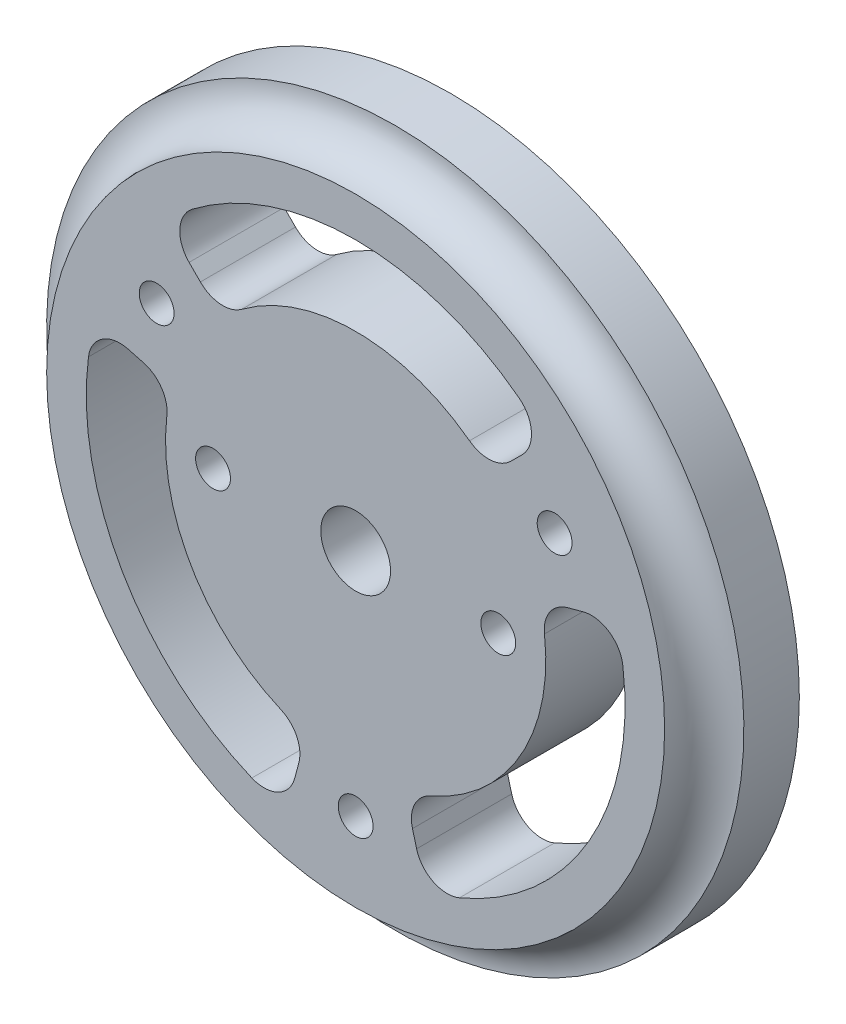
ISO-10303-21;
HEADER;
FILE_DESCRIPTION(('STEP AP214'),'2;1');
FILE_NAME('part.step','',(''),(''),'','','');
FILE_SCHEMA(('AUTOMOTIVE_DESIGN { 1 0 10303 214 1 1 1 1 }'));
ENDSEC;
DATA;
#1=APPLICATION_CONTEXT('core data for automotive mechanical design processes');
#2=APPLICATION_PROTOCOL_DEFINITION('international standard','automotive_design',2000,#1);
#3=PRODUCT_CONTEXT('',#1,'mechanical');
#4=PRODUCT('Part','Part','',(#3));
#5=PRODUCT_RELATED_PRODUCT_CATEGORY('part','',(#4));
#6=PRODUCT_DEFINITION_FORMATION('','',#4);
#7=PRODUCT_DEFINITION_CONTEXT('part definition',#1,'design');
#8=PRODUCT_DEFINITION('design','',#6,#7);
#9=PRODUCT_DEFINITION_SHAPE('','',#8);
#10=(LENGTH_UNIT() NAMED_UNIT(*) SI_UNIT(.MILLI.,.METRE.));
#11=(NAMED_UNIT(*) PLANE_ANGLE_UNIT() SI_UNIT($,.RADIAN.));
#12=(NAMED_UNIT(*) SI_UNIT($,.STERADIAN.) SOLID_ANGLE_UNIT());
#13=UNCERTAINTY_MEASURE_WITH_UNIT(LENGTH_MEASURE(1.E-05),#10,'distance_accuracy_value','');
#14=(GEOMETRIC_REPRESENTATION_CONTEXT(3) GLOBAL_UNCERTAINTY_ASSIGNED_CONTEXT((#13)) GLOBAL_UNIT_ASSIGNED_CONTEXT((#10,
#11,#12)) REPRESENTATION_CONTEXT('',''));
#15=CARTESIAN_POINT('',(0.,0.,0.));
#16=DIRECTION('',(0.,0.,1.));
#17=DIRECTION('',(1.,0.,0.));
#18=AXIS2_PLACEMENT_3D('',#15,#16,#17);
#19=CARTESIAN_POINT('',(0.,0.,6.));
#20=DIRECTION('',(0.,0.,1.));
#21=DIRECTION('',(1.,0.,0.));
#22=AXIS2_PLACEMENT_3D('',#19,#20,#21);
#23=PLANE('',#22);
#24=CARTESIAN_POINT('',(0.,0.,5.99999999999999));
#25=DIRECTION('',(0.,0.,-1.));
#26=DIRECTION('',(0.,1.,0.));
#27=AXIS2_PLACEMENT_3D('',#24,#25,#26);
#28=CIRCLE('',#27,19.5);
#29=CARTESIAN_POINT('',(0.,19.5,6.));
#30=VERTEX_POINT('',#29);
#31=EDGE_CURVE('E427',#30,#30,#28,.T.);
#32=ORIENTED_EDGE('',*,*,#31,.F.);
#33=EDGE_LOOP('',(#32));
#34=FACE_BOUND('',#33,.T.);
#35=CARTESIAN_POINT('',(-9.,0.,6.));
#36=DIRECTION('',(0.,0.,1.));
#37=DIRECTION('',(1.,0.,0.));
#38=AXIS2_PLACEMENT_3D('',#35,#36,#37);
#39=CIRCLE('',#38,1.1);
#40=CARTESIAN_POINT('',(-7.9,0.,6.));
#41=VERTEX_POINT('',#40);
#42=EDGE_CURVE('E231',#41,#41,#39,.T.);
#43=ORIENTED_EDGE('',*,*,#42,.F.);
#44=EDGE_LOOP('',(#43));
#45=FACE_BOUND('',#44,.T.);
#46=CARTESIAN_POINT('',(3.18635775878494E-12,-8.61816253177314E-12,6.));
#47=DIRECTION('',(0.,0.,1.));
#48=DIRECTION('',(1.,0.,0.));
#49=AXIS2_PLACEMENT_3D('',#46,#47,#48);
#50=CIRCLE('',#49,17.000000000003);
#51=CARTESIAN_POINT('',(6.55006981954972,-15.6874658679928,6.));
#52=VERTEX_POINT('',#51);
#53=CARTESIAN_POINT('',(16.8607788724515,2.17120607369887,6.));
#54=VERTEX_POINT('',#53);
#55=EDGE_CURVE('E263',#52,#54,#50,.T.);
#56=ORIENTED_EDGE('',*,*,#55,.F.);
#57=CARTESIAN_POINT('',(5.77947337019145,-13.8418816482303,6.));
#58=DIRECTION('',(0.,0.,1.));
#59=DIRECTION('',(-1.,0.,0.));
#60=AXIS2_PLACEMENT_3D('',#57,#58,#59);
#61=CIRCLE('',#60,2.);
#62=CARTESIAN_POINT('',(3.8476217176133,-14.3595197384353,6.));
#63=VERTEX_POINT('',#62);
#64=EDGE_CURVE('E261',#63,#52,#61,.T.);
#65=ORIENTED_EDGE('',*,*,#64,.F.);
#66=DIRECTION('',(0.258819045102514,-0.96592582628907,0.));
#67=VECTOR('',#66,1.);
#68=CARTESIAN_POINT('',(3.58630188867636,-13.3842608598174,6.));
#69=LINE('',#68,#67);
#70=CARTESIAN_POINT('',(3.58630188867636,-13.3842608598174,6.));
#71=VERTEX_POINT('',#70);
#72=EDGE_CURVE('E277',#71,#63,#69,.T.);
#73=ORIENTED_EDGE('',*,*,#72,.F.);
#74=CARTESIAN_POINT('',(5.5181535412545,-12.8666227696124,6.));
#75=DIRECTION('',(0.,0.,1.));
#76=DIRECTION('',(1.,0.,0.));
#77=AXIS2_PLACEMENT_3D('',#74,#75,#76);
#78=CIRCLE('',#77,2.);
#79=CARTESIAN_POINT('',(4.72984589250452,-11.0285338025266,6.));
#80=VERTEX_POINT('',#79);
#81=EDGE_CURVE('E274',#80,#71,#78,.T.);
#82=ORIENTED_EDGE('',*,*,#81,.F.);
#83=CARTESIAN_POINT('',(3.18635775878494E-12,-8.61816253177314E-12,6.));
#84=DIRECTION('',(0.,0.,-1.));
#85=DIRECTION('',(1.,0.,0.));
#86=AXIS2_PLACEMENT_3D('',#83,#84,#85);
#87=CIRCLE('',#86,12.0000000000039);
#88=CARTESIAN_POINT('',(11.9159133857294,1.41810020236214,6.));
#89=VERTEX_POINT('',#88);
#90=EDGE_CURVE('E272',#89,#80,#87,.T.);
#91=ORIENTED_EDGE('',*,*,#90,.F.);
#92=CARTESIAN_POINT('',(13.9018989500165,1.65445023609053,6.));
#93=DIRECTION('',(0.,0.,1.));
#94=DIRECTION('',(-1.,0.,0.));
#95=AXIS2_PLACEMENT_3D('',#92,#93,#94);
#96=CIRCLE('',#95,2.);
#97=CARTESIAN_POINT('',(13.3842608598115,3.58630188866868,6.));
#98=VERTEX_POINT('',#97);
#99=EDGE_CURVE('E270',#98,#89,#96,.T.);
#100=ORIENTED_EDGE('',*,*,#99,.F.);
#101=DIRECTION('',(-0.965925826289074,-0.258819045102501,0.));
#102=VECTOR('',#101,1.);
#103=CARTESIAN_POINT('',(13.3842608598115,3.58630188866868,6.));
#104=LINE('',#103,#102);
#105=CARTESIAN_POINT('',(14.3595197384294,3.8476217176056,6.));
#106=VERTEX_POINT('',#105);
#107=EDGE_CURVE('E268',#106,#98,#104,.T.);
#108=ORIENTED_EDGE('',*,*,#107,.F.);
#109=CARTESIAN_POINT('',(14.8771578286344,1.91577006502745,6.));
#110=DIRECTION('',(0.,0.,1.));
#111=DIRECTION('',(1.,0.,0.));
#112=AXIS2_PLACEMENT_3D('',#109,#110,#111);
#113=CIRCLE('',#112,2.);
#114=EDGE_CURVE('E266',#54,#106,#113,.T.);
#115=ORIENTED_EDGE('',*,*,#114,.F.);
#116=EDGE_LOOP('',(#56,#65,#73,#82,#91,#100,#108,#115));
#117=FACE_BOUND('',#116,.T.);
#118=CARTESIAN_POINT('',(12.5573683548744,7.24999999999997,6.));
#119=DIRECTION('',(0.,0.,1.));
#120=DIRECTION('',(1.,0.,0.));
#121=AXIS2_PLACEMENT_3D('',#118,#119,#120);
#122=CIRCLE('',#121,1.1);
#123=CARTESIAN_POINT('',(13.6573683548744,7.24999999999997,6.));
#124=VERTEX_POINT('',#123);
#125=EDGE_CURVE('E326',#124,#124,#122,.T.);
#126=ORIENTED_EDGE('',*,*,#125,.F.);
#127=EDGE_LOOP('',(#126));
#128=FACE_BOUND('',#127,.T.);
#129=CARTESIAN_POINT('',(-9.09768445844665,11.9261115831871,6.));
#130=DIRECTION('',(0.,0.,1.));
#131=DIRECTION('',(1.,0.,0.));
#132=AXIS2_PLACEMENT_3D('',#129,#130,#131);
#133=CIRCLE('',#132,1.99999999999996);
#134=CARTESIAN_POINT('',(-10.3107090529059,13.5162597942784,6.));
#135=VERTEX_POINT('',#134);
#136=CARTESIAN_POINT('',(-10.5118980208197,10.5118980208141,6.));
#137=VERTEX_POINT('',#136);
#138=EDGE_CURVE('E340',#135,#137,#133,.T.);
#139=ORIENTED_EDGE('',*,*,#138,.F.);
#140=CARTESIAN_POINT('',(0.,0.,6.));
#141=DIRECTION('',(0.,0.,1.));
#142=DIRECTION('',(1.,0.,0.));
#143=AXIS2_PLACEMENT_3D('',#140,#141,#142);
#144=CIRCLE('',#143,17.000000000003);
#145=CARTESIAN_POINT('',(10.3107090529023,13.5162597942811,6.));
#146=VERTEX_POINT('',#145);
#147=EDGE_CURVE('E338',#146,#135,#144,.T.);
#148=ORIENTED_EDGE('',*,*,#147,.F.);
#149=CARTESIAN_POINT('',(9.09768445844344,11.9261115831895,6.));
#150=DIRECTION('',(0.,0.,1.));
#151=DIRECTION('',(-1.,0.,0.));
#152=AXIS2_PLACEMENT_3D('',#149,#150,#151);
#153=CIRCLE('',#152,2.00000000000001);
#154=CARTESIAN_POINT('',(10.5118980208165,10.5118980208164,6.));
#155=VERTEX_POINT('',#154);
#156=EDGE_CURVE('E354',#155,#146,#153,.T.);
#157=ORIENTED_EDGE('',*,*,#156,.F.);
#158=DIRECTION('',(0.707106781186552,0.707106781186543,0.));
#159=VECTOR('',#158,1.);
#160=CARTESIAN_POINT('',(9.79795897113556,9.79795897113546,6.));
#161=LINE('',#160,#159);
#162=CARTESIAN_POINT('',(9.79795897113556,9.79795897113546,6.));
#163=VERTEX_POINT('',#162);
#164=EDGE_CURVE('E351',#163,#155,#161,.T.);
#165=ORIENTED_EDGE('',*,*,#164,.F.);
#166=CARTESIAN_POINT('',(8.38374540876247,11.2121725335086,6.));
#167=DIRECTION('',(0.,0.,1.));
#168=DIRECTION('',(1.,0.,0.));
#169=AXIS2_PLACEMENT_3D('',#166,#167,#168);
#170=CIRCLE('',#169,1.99999999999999);
#171=CARTESIAN_POINT('',(7.18606749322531,9.61043360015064,6.));
#172=VERTEX_POINT('',#171);
#173=EDGE_CURVE('E349',#172,#163,#170,.T.);
#174=ORIENTED_EDGE('',*,*,#173,.F.);
#175=CARTESIAN_POINT('',(0.,0.,6.));
#176=DIRECTION('',(0.,0.,-1.));
#177=DIRECTION('',(1.,0.,0.));
#178=AXIS2_PLACEMENT_3D('',#175,#176,#177);
#179=CIRCLE('',#178,12.0000000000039);
#180=CARTESIAN_POINT('',(-7.18606749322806,9.61043360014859,6.));
#181=VERTEX_POINT('',#180);
#182=EDGE_CURVE('E347',#181,#172,#179,.T.);
#183=ORIENTED_EDGE('',*,*,#182,.F.);
#184=CARTESIAN_POINT('',(-8.38374540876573,11.2121725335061,6.));
#185=DIRECTION('',(0.,0.,1.));
#186=DIRECTION('',(-1.,0.,0.));
#187=AXIS2_PLACEMENT_3D('',#184,#185,#186);
#188=CIRCLE('',#187,1.99999999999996);
#189=CARTESIAN_POINT('',(-9.79795897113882,9.79795897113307,6.));
#190=VERTEX_POINT('',#189);
#191=EDGE_CURVE('E345',#190,#181,#188,.T.);
#192=ORIENTED_EDGE('',*,*,#191,.F.);
#193=DIRECTION('',(0.707106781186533,-0.707106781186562,0.));
#194=VECTOR('',#193,1.);
#195=CARTESIAN_POINT('',(-9.7979589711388,9.7979589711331,6.));
#196=LINE('',#195,#194);
#197=EDGE_CURVE('E343',#137,#190,#196,.T.);
#198=ORIENTED_EDGE('',*,*,#197,.F.);
#199=EDGE_LOOP('',(#139,#148,#157,#165,#174,#183,#192,#198));
#200=FACE_BOUND('',#199,.T.);
#201=CARTESIAN_POINT('',(0.,0.,6.));
#202=DIRECTION('',(0.,0.,1.));
#203=DIRECTION('',(1.,0.,0.));
#204=AXIS2_PLACEMENT_3D('',#201,#202,#203);
#205=CIRCLE('',#204,2.2);
#206=CARTESIAN_POINT('',(2.2,0.,6.));
#207=VERTEX_POINT('',#206);
#208=EDGE_CURVE('E40',#207,#207,#205,.T.);
#209=ORIENTED_EDGE('',*,*,#208,.F.);
#210=EDGE_LOOP('',(#209));
#211=FACE_BOUND('',#210,.T.);
#212=CARTESIAN_POINT('',(0.,-14.5,6.));
#213=DIRECTION('',(0.,0.,1.));
#214=DIRECTION('',(1.,0.,0.));
#215=AXIS2_PLACEMENT_3D('',#212,#213,#214);
#216=CIRCLE('',#215,1.1);
#217=CARTESIAN_POINT('',(1.0999999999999,-14.5,6.));
#218=VERTEX_POINT('',#217);
#219=EDGE_CURVE('E332',#218,#218,#216,.T.);
#220=ORIENTED_EDGE('',*,*,#219,.F.);
#221=EDGE_LOOP('',(#220));
#222=FACE_BOUND('',#221,.T.);
#223=CARTESIAN_POINT('',(-12.5573683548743,7.25000000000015,6.));
#224=DIRECTION('',(0.,0.,1.));
#225=DIRECTION('',(1.,0.,0.));
#226=AXIS2_PLACEMENT_3D('',#223,#224,#225);
#227=CIRCLE('',#226,1.1);
#228=CARTESIAN_POINT('',(-11.4573683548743,7.25000000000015,6.));
#229=VERTEX_POINT('',#228);
#230=EDGE_CURVE('E320',#229,#229,#227,.T.);
#231=ORIENTED_EDGE('',*,*,#230,.F.);
#232=EDGE_LOOP('',(#231));
#233=FACE_BOUND('',#232,.T.);
#234=CARTESIAN_POINT('',(-5.87036880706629E-12,-7.06854803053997E-12,6.));
#235=DIRECTION('',(0.,0.,1.));
#236=DIRECTION('',(1.,0.,0.));
#237=AXIS2_PLACEMENT_3D('',#234,#235,#236);
#238=CIRCLE('',#237,17.000000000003);
#239=CARTESIAN_POINT('',(-16.8607788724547,2.17120607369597,6.));
#240=VERTEX_POINT('',#239);
#241=CARTESIAN_POINT('',(-6.55006981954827,-15.687465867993,6.));
#242=VERTEX_POINT('',#241);
#243=EDGE_CURVE('E201',#240,#242,#238,.T.);
#244=ORIENTED_EDGE('',*,*,#243,.F.);
#245=CARTESIAN_POINT('',(-14.8771578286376,1.91577006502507,6.));
#246=DIRECTION('',(0.,0.,1.));
#247=DIRECTION('',(-1.,0.,0.));
#248=AXIS2_PLACEMENT_3D('',#245,#246,#247);
#249=CIRCLE('',#248,2.);
#250=CARTESIAN_POINT('',(-14.3595197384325,3.8476217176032,6.));
#251=VERTEX_POINT('',#250);
#252=EDGE_CURVE('E193',#251,#240,#249,.T.);
#253=ORIENTED_EDGE('',*,*,#252,.F.);
#254=DIRECTION('',(-0.965925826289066,0.258819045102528,0.));
#255=VECTOR('',#254,1.);
#256=CARTESIAN_POINT('',(-13.3842608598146,3.58630188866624,6.));
#257=LINE('',#256,#255);
#258=CARTESIAN_POINT('',(-13.3842608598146,3.58630188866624,6.));
#259=VERTEX_POINT('',#258);
#260=EDGE_CURVE('E228',#259,#251,#257,.T.);
#261=ORIENTED_EDGE('',*,*,#260,.F.);
#262=CARTESIAN_POINT('',(-13.9018989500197,1.65445023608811,6.));
#263=DIRECTION('',(0.,0.,1.));
#264=DIRECTION('',(1.,0.,0.));
#265=AXIS2_PLACEMENT_3D('',#262,#263,#264);
#266=CIRCLE('',#265,2.);
#267=CARTESIAN_POINT('',(-11.9159133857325,1.41810020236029,6.));
#268=VERTEX_POINT('',#267);
#269=EDGE_CURVE('E226',#268,#259,#266,.T.);
#270=ORIENTED_EDGE('',*,*,#269,.F.);
#271=CARTESIAN_POINT('',(-5.87036880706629E-12,-7.06854803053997E-12,6.));
#272=DIRECTION('',(0.,0.,-1.));
#273=DIRECTION('',(1.,0.,0.));
#274=AXIS2_PLACEMENT_3D('',#271,#272,#273);
#275=CIRCLE('',#274,12.0000000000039);
#276=CARTESIAN_POINT('',(-4.72984589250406,-11.0285338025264,6.));
#277=VERTEX_POINT('',#276);
#278=EDGE_CURVE('E224',#277,#268,#275,.T.);
#279=ORIENTED_EDGE('',*,*,#278,.F.);
#280=CARTESIAN_POINT('',(-5.5181535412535,-12.8666227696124,6.));
#281=DIRECTION('',(0.,0.,1.));
#282=DIRECTION('',(-1.,0.,0.));
#283=AXIS2_PLACEMENT_3D('',#280,#281,#282);
#284=CIRCLE('',#283,2.);
#285=CARTESIAN_POINT('',(-3.58630188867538,-13.3842608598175,6.));
#286=VERTEX_POINT('',#285);
#287=EDGE_CURVE('E222',#286,#277,#284,.T.);
#288=ORIENTED_EDGE('',*,*,#287,.F.);
#289=DIRECTION('',(0.258819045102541,0.965925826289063,0.));
#290=VECTOR('',#289,1.);
#291=CARTESIAN_POINT('',(-3.58630188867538,-13.3842608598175,6.));
#292=LINE('',#291,#290);
#293=CARTESIAN_POINT('',(-3.84762171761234,-14.3595197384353,6.));
#294=VERTEX_POINT('',#293);
#295=EDGE_CURVE('E217',#294,#286,#292,.T.);
#296=ORIENTED_EDGE('',*,*,#295,.F.);
#297=CARTESIAN_POINT('',(-5.77947337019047,-13.8418816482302,6.));
#298=DIRECTION('',(0.,0.,1.));
#299=DIRECTION('',(1.,0.,0.));
#300=AXIS2_PLACEMENT_3D('',#297,#298,#299);
#301=CIRCLE('',#300,2.);
#302=EDGE_CURVE('E215',#242,#294,#301,.T.);
#303=ORIENTED_EDGE('',*,*,#302,.F.);
#304=EDGE_LOOP('',(#244,#253,#261,#270,#279,#288,#296,#303));
#305=FACE_BOUND('',#304,.T.);
#306=CARTESIAN_POINT('',(9.,0.,6.));
#307=DIRECTION('',(0.,0.,1.));
#308=DIRECTION('',(1.,0.,0.));
#309=AXIS2_PLACEMENT_3D('',#306,#307,#308);
#310=CIRCLE('',#309,1.1);
#311=CARTESIAN_POINT('',(10.1,0.,6.));
#312=VERTEX_POINT('',#311);
#313=EDGE_CURVE('E461',#312,#312,#310,.T.);
#314=ORIENTED_EDGE('',*,*,#313,.F.);
#315=EDGE_LOOP('',(#314));
#316=FACE_BOUND('',#315,.T.);
#317=ADVANCED_FACE('F32',(#34,#45,#117,#128,#200,#211,#222,#233,#305,#316),#23,.T.);
#318=CARTESIAN_POINT('',(0.,0.,0.));
#319=DIRECTION('',(0.,0.,1.));
#320=DIRECTION('',(1.,0.,0.));
#321=AXIS2_PLACEMENT_3D('',#318,#319,#320);
#322=PLANE('',#321);
#323=CARTESIAN_POINT('',(-9.,0.,0.));
#324=DIRECTION('',(0.,0.,1.));
#325=DIRECTION('',(1.,0.,0.));
#326=AXIS2_PLACEMENT_3D('',#323,#324,#325);
#327=CIRCLE('',#326,1.1);
#328=CARTESIAN_POINT('',(-7.9,0.,0.));
#329=VERTEX_POINT('',#328);
#330=EDGE_CURVE('E465',#329,#329,#327,.T.);
#331=ORIENTED_EDGE('',*,*,#330,.T.);
#332=EDGE_LOOP('',(#331));
#333=FACE_BOUND('',#332,.T.);
#334=CARTESIAN_POINT('',(5.77947337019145,-13.8418816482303,0.));
#335=DIRECTION('',(0.,0.,1.));
#336=DIRECTION('',(-1.,0.,0.));
#337=AXIS2_PLACEMENT_3D('',#334,#335,#336);
#338=CIRCLE('',#337,2.);
#339=CARTESIAN_POINT('',(3.8476217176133,-14.3595197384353,0.));
#340=VERTEX_POINT('',#339);
#341=CARTESIAN_POINT('',(6.55006981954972,-15.6874658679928,0.));
#342=VERTEX_POINT('',#341);
#343=EDGE_CURVE('E209',#340,#342,#338,.T.);
#344=ORIENTED_EDGE('',*,*,#343,.T.);
#345=CARTESIAN_POINT('',(3.18635775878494E-12,-8.61816253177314E-12,0.));
#346=DIRECTION('',(0.,0.,1.));
#347=DIRECTION('',(1.,0.,0.));
#348=AXIS2_PLACEMENT_3D('',#345,#346,#347);
#349=CIRCLE('',#348,17.000000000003);
#350=CARTESIAN_POINT('',(16.8607788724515,2.17120607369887,0.));
#351=VERTEX_POINT('',#350);
#352=EDGE_CURVE('E282',#342,#351,#349,.T.);
#353=ORIENTED_EDGE('',*,*,#352,.T.);
#354=CARTESIAN_POINT('',(14.8771578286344,1.91577006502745,0.));
#355=DIRECTION('',(0.,0.,1.));
#356=DIRECTION('',(1.,0.,0.));
#357=AXIS2_PLACEMENT_3D('',#354,#355,#356);
#358=CIRCLE('',#357,2.);
#359=CARTESIAN_POINT('',(14.3595197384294,3.8476217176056,0.));
#360=VERTEX_POINT('',#359);
#361=EDGE_CURVE('E285',#351,#360,#358,.T.);
#362=ORIENTED_EDGE('',*,*,#361,.T.);
#363=DIRECTION('',(-0.965925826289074,-0.258819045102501,0.));
#364=VECTOR('',#363,1.);
#365=CARTESIAN_POINT('',(13.3842608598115,3.58630188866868,0.));
#366=LINE('',#365,#364);
#367=CARTESIAN_POINT('',(13.3842608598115,3.58630188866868,0.));
#368=VERTEX_POINT('',#367);
#369=EDGE_CURVE('E288',#360,#368,#366,.T.);
#370=ORIENTED_EDGE('',*,*,#369,.T.);
#371=CARTESIAN_POINT('',(13.9018989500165,1.65445023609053,0.));
#372=DIRECTION('',(0.,0.,1.));
#373=DIRECTION('',(-1.,0.,0.));
#374=AXIS2_PLACEMENT_3D('',#371,#372,#373);
#375=CIRCLE('',#374,2.);
#376=CARTESIAN_POINT('',(11.9159133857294,1.41810020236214,0.));
#377=VERTEX_POINT('',#376);
#378=EDGE_CURVE('E291',#368,#377,#375,.T.);
#379=ORIENTED_EDGE('',*,*,#378,.T.);
#380=CARTESIAN_POINT('',(3.18635775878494E-12,-8.61816253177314E-12,0.));
#381=DIRECTION('',(0.,0.,-1.));
#382=DIRECTION('',(1.,0.,0.));
#383=AXIS2_PLACEMENT_3D('',#380,#381,#382);
#384=CIRCLE('',#383,12.0000000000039);
#385=CARTESIAN_POINT('',(4.72984589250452,-11.0285338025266,0.));
#386=VERTEX_POINT('',#385);
#387=EDGE_CURVE('E294',#377,#386,#384,.T.);
#388=ORIENTED_EDGE('',*,*,#387,.T.);
#389=CARTESIAN_POINT('',(5.5181535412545,-12.8666227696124,0.));
#390=DIRECTION('',(0.,0.,1.));
#391=DIRECTION('',(1.,0.,0.));
#392=AXIS2_PLACEMENT_3D('',#389,#390,#391);
#393=CIRCLE('',#392,2.);
#394=CARTESIAN_POINT('',(3.58630188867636,-13.3842608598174,0.));
#395=VERTEX_POINT('',#394);
#396=EDGE_CURVE('E297',#386,#395,#393,.T.);
#397=ORIENTED_EDGE('',*,*,#396,.T.);
#398=DIRECTION('',(0.258819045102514,-0.96592582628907,0.));
#399=VECTOR('',#398,1.);
#400=CARTESIAN_POINT('',(3.58630188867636,-13.3842608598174,0.));
#401=LINE('',#400,#399);
#402=EDGE_CURVE('E264',#395,#340,#401,.T.);
#403=ORIENTED_EDGE('',*,*,#402,.T.);
#404=EDGE_LOOP('',(#344,#353,#362,#370,#379,#388,#397,#403));
#405=FACE_BOUND('',#404,.T.);
#406=CARTESIAN_POINT('',(12.5573683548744,7.24999999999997,0.));
#407=DIRECTION('',(0.,0.,1.));
#408=DIRECTION('',(1.,0.,0.));
#409=AXIS2_PLACEMENT_3D('',#406,#407,#408);
#410=CIRCLE('',#409,1.1);
#411=CARTESIAN_POINT('',(13.6573683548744,7.24999999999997,0.));
#412=VERTEX_POINT('',#411);
#413=EDGE_CURVE('E323',#412,#412,#410,.T.);
#414=ORIENTED_EDGE('',*,*,#413,.T.);
#415=EDGE_LOOP('',(#414));
#416=FACE_BOUND('',#415,.T.);
#417=CARTESIAN_POINT('',(0.,0.,0.));
#418=DIRECTION('',(0.,0.,1.));
#419=DIRECTION('',(1.,0.,0.));
#420=AXIS2_PLACEMENT_3D('',#417,#418,#419);
#421=CIRCLE('',#420,17.000000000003);
#422=CARTESIAN_POINT('',(10.3107090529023,13.5162597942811,0.));
#423=VERTEX_POINT('',#422);
#424=CARTESIAN_POINT('',(-10.3107090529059,13.5162597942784,0.));
#425=VERTEX_POINT('',#424);
#426=EDGE_CURVE('E335',#423,#425,#421,.T.);
#427=ORIENTED_EDGE('',*,*,#426,.T.);
#428=CARTESIAN_POINT('',(-9.09768445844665,11.9261115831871,0.));
#429=DIRECTION('',(0.,0.,1.));
#430=DIRECTION('',(1.,0.,0.));
#431=AXIS2_PLACEMENT_3D('',#428,#429,#430);
#432=CIRCLE('',#431,1.99999999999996);
#433=CARTESIAN_POINT('',(-10.5118980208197,10.5118980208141,0.));
#434=VERTEX_POINT('',#433);
#435=EDGE_CURVE('E359',#425,#434,#432,.T.);
#436=ORIENTED_EDGE('',*,*,#435,.T.);
#437=DIRECTION('',(0.707106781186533,-0.707106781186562,0.));
#438=VECTOR('',#437,1.);
#439=CARTESIAN_POINT('',(-9.7979589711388,9.7979589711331,0.));
#440=LINE('',#439,#438);
#441=CARTESIAN_POINT('',(-9.79795897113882,9.79795897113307,0.));
#442=VERTEX_POINT('',#441);
#443=EDGE_CURVE('E362',#434,#442,#440,.T.);
#444=ORIENTED_EDGE('',*,*,#443,.T.);
#445=CARTESIAN_POINT('',(-8.38374540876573,11.2121725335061,0.));
#446=DIRECTION('',(0.,0.,1.));
#447=DIRECTION('',(-1.,0.,0.));
#448=AXIS2_PLACEMENT_3D('',#445,#446,#447);
#449=CIRCLE('',#448,1.99999999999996);
#450=CARTESIAN_POINT('',(-7.18606749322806,9.61043360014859,0.));
#451=VERTEX_POINT('',#450);
#452=EDGE_CURVE('E365',#442,#451,#449,.T.);
#453=ORIENTED_EDGE('',*,*,#452,.T.);
#454=CARTESIAN_POINT('',(0.,0.,0.));
#455=DIRECTION('',(0.,0.,-1.));
#456=DIRECTION('',(1.,0.,0.));
#457=AXIS2_PLACEMENT_3D('',#454,#455,#456);
#458=CIRCLE('',#457,12.0000000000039);
#459=CARTESIAN_POINT('',(7.18606749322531,9.61043360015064,0.));
#460=VERTEX_POINT('',#459);
#461=EDGE_CURVE('E368',#451,#460,#458,.T.);
#462=ORIENTED_EDGE('',*,*,#461,.T.);
#463=CARTESIAN_POINT('',(8.38374540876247,11.2121725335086,0.));
#464=DIRECTION('',(0.,0.,1.));
#465=DIRECTION('',(1.,0.,0.));
#466=AXIS2_PLACEMENT_3D('',#463,#464,#465);
#467=CIRCLE('',#466,1.99999999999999);
#468=CARTESIAN_POINT('',(9.79795897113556,9.79795897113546,0.));
#469=VERTEX_POINT('',#468);
#470=EDGE_CURVE('E371',#460,#469,#467,.T.);
#471=ORIENTED_EDGE('',*,*,#470,.T.);
#472=DIRECTION('',(0.707106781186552,0.707106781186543,0.));
#473=VECTOR('',#472,1.);
#474=CARTESIAN_POINT('',(9.79795897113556,9.79795897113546,0.));
#475=LINE('',#474,#473);
#476=CARTESIAN_POINT('',(10.5118980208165,10.5118980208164,0.));
#477=VERTEX_POINT('',#476);
#478=EDGE_CURVE('E374',#469,#477,#475,.T.);
#479=ORIENTED_EDGE('',*,*,#478,.T.);
#480=CARTESIAN_POINT('',(9.09768445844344,11.9261115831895,0.));
#481=DIRECTION('',(0.,0.,1.));
#482=DIRECTION('',(-1.,0.,0.));
#483=AXIS2_PLACEMENT_3D('',#480,#481,#482);
#484=CIRCLE('',#483,2.00000000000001);
#485=EDGE_CURVE('E341',#477,#423,#484,.T.);
#486=ORIENTED_EDGE('',*,*,#485,.T.);
#487=EDGE_LOOP('',(#427,#436,#444,#453,#462,#471,#479,#486));
#488=FACE_BOUND('',#487,.T.);
#489=CARTESIAN_POINT('',(0.,0.,0.));
#490=DIRECTION('',(0.,0.,1.));
#491=DIRECTION('',(1.,0.,0.));
#492=AXIS2_PLACEMENT_3D('',#489,#490,#491);
#493=CIRCLE('',#492,22.);
#494=CARTESIAN_POINT('',(22.,0.,0.));
#495=VERTEX_POINT('',#494);
#496=EDGE_CURVE('E11',#495,#495,#493,.T.);
#497=ORIENTED_EDGE('',*,*,#496,.F.);
#498=EDGE_LOOP('',(#497));
#499=FACE_BOUND('',#498,.T.);
#500=CARTESIAN_POINT('',(0.,0.,0.));
#501=DIRECTION('',(0.,0.,1.));
#502=DIRECTION('',(1.,0.,0.));
#503=AXIS2_PLACEMENT_3D('',#500,#501,#502);
#504=CIRCLE('',#503,2.2);
#505=CARTESIAN_POINT('',(2.2,0.,0.));
#506=VERTEX_POINT('',#505);
#507=EDGE_CURVE('E396',#506,#506,#504,.T.);
#508=ORIENTED_EDGE('',*,*,#507,.T.);
#509=EDGE_LOOP('',(#508));
#510=FACE_BOUND('',#509,.T.);
#511=CARTESIAN_POINT('',(0.,-14.5,0.));
#512=DIRECTION('',(0.,0.,1.));
#513=DIRECTION('',(1.,0.,0.));
#514=AXIS2_PLACEMENT_3D('',#511,#512,#513);
#515=CIRCLE('',#514,1.1);
#516=CARTESIAN_POINT('',(1.0999999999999,-14.5,0.));
#517=VERTEX_POINT('',#516);
#518=EDGE_CURVE('E329',#517,#517,#515,.T.);
#519=ORIENTED_EDGE('',*,*,#518,.T.);
#520=EDGE_LOOP('',(#519));
#521=FACE_BOUND('',#520,.T.);
#522=CARTESIAN_POINT('',(-12.5573683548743,7.25000000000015,0.));
#523=DIRECTION('',(0.,0.,1.));
#524=DIRECTION('',(1.,0.,0.));
#525=AXIS2_PLACEMENT_3D('',#522,#523,#524);
#526=CIRCLE('',#525,1.1);
#527=CARTESIAN_POINT('',(-11.4573683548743,7.25000000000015,0.));
#528=VERTEX_POINT('',#527);
#529=EDGE_CURVE('E319',#528,#528,#526,.T.);
#530=ORIENTED_EDGE('',*,*,#529,.T.);
#531=EDGE_LOOP('',(#530));
#532=FACE_BOUND('',#531,.T.);
#533=CARTESIAN_POINT('',(-14.8771578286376,1.91577006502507,0.));
#534=DIRECTION('',(0.,0.,1.));
#535=DIRECTION('',(-1.,0.,0.));
#536=AXIS2_PLACEMENT_3D('',#533,#534,#535);
#537=CIRCLE('',#536,2.);
#538=CARTESIAN_POINT('',(-14.3595197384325,3.8476217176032,0.));
#539=VERTEX_POINT('',#538);
#540=CARTESIAN_POINT('',(-16.8607788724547,2.17120607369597,0.));
#541=VERTEX_POINT('',#540);
#542=EDGE_CURVE('E55',#539,#541,#537,.T.);
#543=ORIENTED_EDGE('',*,*,#542,.T.);
#544=CARTESIAN_POINT('',(-5.87036880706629E-12,-7.06854803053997E-12,0.));
#545=DIRECTION('',(0.,0.,1.));
#546=DIRECTION('',(1.,0.,0.));
#547=AXIS2_PLACEMENT_3D('',#544,#545,#546);
#548=CIRCLE('',#547,17.000000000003);
#549=CARTESIAN_POINT('',(-6.55006981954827,-15.687465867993,0.));
#550=VERTEX_POINT('',#549);
#551=EDGE_CURVE('E208',#541,#550,#548,.T.);
#552=ORIENTED_EDGE('',*,*,#551,.T.);
#553=CARTESIAN_POINT('',(-5.77947337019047,-13.8418816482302,0.));
#554=DIRECTION('',(0.,0.,1.));
#555=DIRECTION('',(1.,0.,0.));
#556=AXIS2_PLACEMENT_3D('',#553,#554,#555);
#557=CIRCLE('',#556,2.);
#558=CARTESIAN_POINT('',(-3.84762171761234,-14.3595197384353,0.));
#559=VERTEX_POINT('',#558);
#560=EDGE_CURVE('E233',#550,#559,#557,.T.);
#561=ORIENTED_EDGE('',*,*,#560,.T.);
#562=DIRECTION('',(0.258819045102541,0.965925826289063,0.));
#563=VECTOR('',#562,1.);
#564=CARTESIAN_POINT('',(-3.58630188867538,-13.3842608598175,0.));
#565=LINE('',#564,#563);
#566=CARTESIAN_POINT('',(-3.58630188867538,-13.3842608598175,0.));
#567=VERTEX_POINT('',#566);
#568=EDGE_CURVE('E236',#559,#567,#565,.T.);
#569=ORIENTED_EDGE('',*,*,#568,.T.);
#570=CARTESIAN_POINT('',(-5.5181535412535,-12.8666227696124,0.));
#571=DIRECTION('',(0.,0.,1.));
#572=DIRECTION('',(-1.,0.,0.));
#573=AXIS2_PLACEMENT_3D('',#570,#571,#572);
#574=CIRCLE('',#573,2.);
#575=CARTESIAN_POINT('',(-4.72984589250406,-11.0285338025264,0.));
#576=VERTEX_POINT('',#575);
#577=EDGE_CURVE('E239',#567,#576,#574,.T.);
#578=ORIENTED_EDGE('',*,*,#577,.T.);
#579=CARTESIAN_POINT('',(-5.87036880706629E-12,-7.06854803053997E-12,0.));
#580=DIRECTION('',(0.,0.,-1.));
#581=DIRECTION('',(1.,0.,0.));
#582=AXIS2_PLACEMENT_3D('',#579,#580,#581);
#583=CIRCLE('',#582,12.0000000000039);
#584=CARTESIAN_POINT('',(-11.9159133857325,1.41810020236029,0.));
#585=VERTEX_POINT('',#584);
#586=EDGE_CURVE('E242',#576,#585,#583,.T.);
#587=ORIENTED_EDGE('',*,*,#586,.T.);
#588=CARTESIAN_POINT('',(-13.9018989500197,1.65445023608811,0.));
#589=DIRECTION('',(0.,0.,1.));
#590=DIRECTION('',(1.,0.,0.));
#591=AXIS2_PLACEMENT_3D('',#588,#589,#590);
#592=CIRCLE('',#591,2.);
#593=CARTESIAN_POINT('',(-13.3842608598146,3.58630188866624,0.));
#594=VERTEX_POINT('',#593);
#595=EDGE_CURVE('E245',#585,#594,#592,.T.);
#596=ORIENTED_EDGE('',*,*,#595,.T.);
#597=DIRECTION('',(-0.965925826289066,0.258819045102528,0.));
#598=VECTOR('',#597,1.);
#599=CARTESIAN_POINT('',(-13.3842608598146,3.58630188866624,0.));
#600=LINE('',#599,#598);
#601=EDGE_CURVE('E202',#594,#539,#600,.T.);
#602=ORIENTED_EDGE('',*,*,#601,.T.);
#603=EDGE_LOOP('',(#543,#552,#561,#569,#578,#587,#596,#602));
#604=FACE_BOUND('',#603,.T.);
#605=CARTESIAN_POINT('',(9.,0.,0.));
#606=DIRECTION('',(0.,0.,1.));
#607=DIRECTION('',(1.,0.,0.));
#608=AXIS2_PLACEMENT_3D('',#605,#606,#607);
#609=CIRCLE('',#608,1.1);
#610=CARTESIAN_POINT('',(10.1,0.,0.));
#611=VERTEX_POINT('',#610);
#612=EDGE_CURVE('E459',#611,#611,#609,.T.);
#613=ORIENTED_EDGE('',*,*,#612,.T.);
#614=EDGE_LOOP('',(#613));
#615=FACE_BOUND('',#614,.T.);
#616=ADVANCED_FACE('F401',(#333,#405,#416,#488,#499,#510,#521,#532,#604,#615),#322,.F.);
#617=CARTESIAN_POINT('',(0.,0.,6.));
#618=DIRECTION('',(0.,0.,-1.));
#619=DIRECTION('',(-1.,0.,0.));
#620=AXIS2_PLACEMENT_3D('',#617,#618,#619);
#621=CYLINDRICAL_SURFACE('',#620,22.);
#622=CARTESIAN_POINT('',(0.,0.,3.5));
#623=DIRECTION('',(0.,0.,-1.));
#624=DIRECTION('',(0.,1.,0.));
#625=AXIS2_PLACEMENT_3D('',#622,#623,#624);
#626=CIRCLE('',#625,22.);
#627=CARTESIAN_POINT('',(0.,22.,3.5));
#628=VERTEX_POINT('',#627);
#629=EDGE_CURVE('E462',#628,#628,#626,.T.);
#630=ORIENTED_EDGE('',*,*,#629,.T.);
#631=EDGE_LOOP('',(#630));
#632=FACE_BOUND('',#631,.T.);
#633=ORIENTED_EDGE('',*,*,#496,.T.);
#634=EDGE_LOOP('',(#633));
#635=FACE_BOUND('',#634,.T.);
#636=ADVANCED_FACE('F34',(#632,#635),#621,.T.);
#637=CARTESIAN_POINT('',(0.,0.,6.));
#638=DIRECTION('',(0.,0.,-1.));
#639=DIRECTION('',(-1.,0.,0.));
#640=AXIS2_PLACEMENT_3D('',#637,#638,#639);
#641=CYLINDRICAL_SURFACE('',#640,2.2);
#642=ORIENTED_EDGE('',*,*,#208,.T.);
#643=EDGE_LOOP('',(#642));
#644=FACE_BOUND('',#643,.T.);
#645=ORIENTED_EDGE('',*,*,#507,.F.);
#646=EDGE_LOOP('',(#645));
#647=FACE_BOUND('',#646,.T.);
#648=ADVANCED_FACE('F404',(#644,#647),#641,.F.);
#649=CARTESIAN_POINT('',(0.,0.,6.));
#650=DIRECTION('',(0.,0.,-1.));
#651=DIRECTION('',(-1.,0.,0.));
#652=AXIS2_PLACEMENT_3D('',#649,#650,#651);
#653=CYLINDRICAL_SURFACE('',#652,17.000000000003);
#654=ORIENTED_EDGE('',*,*,#426,.F.);
#655=DIRECTION('',(0.,0.,-1.));
#656=VECTOR('',#655,1.);
#657=CARTESIAN_POINT('',(10.3107090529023,13.5162597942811,6.));
#658=LINE('',#657,#656);
#659=EDGE_CURVE('E356',#146,#423,#658,.T.);
#660=ORIENTED_EDGE('',*,*,#659,.F.);
#661=ORIENTED_EDGE('',*,*,#147,.T.);
#662=DIRECTION('',(0.,0.,-1.));
#663=VECTOR('',#662,1.);
#664=CARTESIAN_POINT('',(-10.3107090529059,13.5162597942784,6.));
#665=LINE('',#664,#663);
#666=EDGE_CURVE('E393',#135,#425,#665,.T.);
#667=ORIENTED_EDGE('',*,*,#666,.T.);
#668=EDGE_LOOP('',(#654,#660,#661,#667));
#669=FACE_BOUND('',#668,.T.);
#670=ADVANCED_FACE('F406',(#669),#653,.F.);
#671=CARTESIAN_POINT('',(-9.09768445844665,11.9261115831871,6.));
#672=DIRECTION('',(0.,0.,-1.));
#673=DIRECTION('',(-1.,0.,0.));
#674=AXIS2_PLACEMENT_3D('',#671,#672,#673);
#675=CYLINDRICAL_SURFACE('',#674,1.99999999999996);
#676=ORIENTED_EDGE('',*,*,#435,.F.);
#677=ORIENTED_EDGE('',*,*,#666,.F.);
#678=ORIENTED_EDGE('',*,*,#138,.T.);
#679=DIRECTION('',(0.,0.,-1.));
#680=VECTOR('',#679,1.);
#681=CARTESIAN_POINT('',(-10.5118980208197,10.5118980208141,6.));
#682=LINE('',#681,#680);
#683=EDGE_CURVE('E391',#137,#434,#682,.T.);
#684=ORIENTED_EDGE('',*,*,#683,.T.);
#685=EDGE_LOOP('',(#676,#677,#678,#684));
#686=FACE_BOUND('',#685,.T.);
#687=ADVANCED_FACE('F413',(#686),#675,.F.);
#688=CARTESIAN_POINT('',(-9.7979589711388,9.7979589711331,6.));
#689=DIRECTION('',(0.707106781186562,0.707106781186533,0.));
#690=DIRECTION('',(-0.707106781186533,0.707106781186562,0.));
#691=AXIS2_PLACEMENT_3D('',#688,#689,#690);
#692=PLANE('',#691);
#693=ORIENTED_EDGE('',*,*,#443,.F.);
#694=ORIENTED_EDGE('',*,*,#683,.F.);
#695=ORIENTED_EDGE('',*,*,#197,.T.);
#696=DIRECTION('',(0.,0.,-1.));
#697=VECTOR('',#696,1.);
#698=CARTESIAN_POINT('',(-9.79795897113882,9.79795897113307,6.));
#699=LINE('',#698,#697);
#700=EDGE_CURVE('E389',#190,#442,#699,.T.);
#701=ORIENTED_EDGE('',*,*,#700,.T.);
#702=EDGE_LOOP('',(#693,#694,#695,#701));
#703=FACE_BOUND('',#702,.T.);
#704=ADVANCED_FACE('F571',(#703),#692,.T.);
#705=CARTESIAN_POINT('',(-8.38374540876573,11.2121725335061,6.));
#706=DIRECTION('',(0.,0.,-1.));
#707=DIRECTION('',(-1.,0.,0.));
#708=AXIS2_PLACEMENT_3D('',#705,#706,#707);
#709=CYLINDRICAL_SURFACE('',#708,1.99999999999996);
#710=ORIENTED_EDGE('',*,*,#452,.F.);
#711=ORIENTED_EDGE('',*,*,#700,.F.);
#712=ORIENTED_EDGE('',*,*,#191,.T.);
#713=DIRECTION('',(0.,0.,-1.));
#714=VECTOR('',#713,1.);
#715=CARTESIAN_POINT('',(-7.18606749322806,9.61043360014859,6.));
#716=LINE('',#715,#714);
#717=EDGE_CURVE('E387',#181,#451,#716,.T.);
#718=ORIENTED_EDGE('',*,*,#717,.T.);
#719=EDGE_LOOP('',(#710,#711,#712,#718));
#720=FACE_BOUND('',#719,.T.);
#721=ADVANCED_FACE('F567',(#720),#709,.F.);
#722=CARTESIAN_POINT('',(0.,0.,6.));
#723=DIRECTION('',(0.,0.,-1.));
#724=DIRECTION('',(-1.,0.,0.));
#725=AXIS2_PLACEMENT_3D('',#722,#723,#724);
#726=CYLINDRICAL_SURFACE('',#725,12.0000000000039);
#727=ORIENTED_EDGE('',*,*,#461,.F.);
#728=ORIENTED_EDGE('',*,*,#717,.F.);
#729=ORIENTED_EDGE('',*,*,#182,.T.);
#730=DIRECTION('',(0.,0.,-1.));
#731=VECTOR('',#730,1.);
#732=CARTESIAN_POINT('',(7.18606749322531,9.61043360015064,6.));
#733=LINE('',#732,#731);
#734=EDGE_CURVE('E385',#172,#460,#733,.T.);
#735=ORIENTED_EDGE('',*,*,#734,.T.);
#736=EDGE_LOOP('',(#727,#728,#729,#735));
#737=FACE_BOUND('',#736,.T.);
#738=ADVANCED_FACE('F563',(#737),#726,.T.);
#739=CARTESIAN_POINT('',(8.38374540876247,11.2121725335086,6.));
#740=DIRECTION('',(0.,0.,-1.));
#741=DIRECTION('',(-1.,0.,0.));
#742=AXIS2_PLACEMENT_3D('',#739,#740,#741);
#743=CYLINDRICAL_SURFACE('',#742,1.99999999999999);
#744=ORIENTED_EDGE('',*,*,#470,.F.);
#745=ORIENTED_EDGE('',*,*,#734,.F.);
#746=ORIENTED_EDGE('',*,*,#173,.T.);
#747=DIRECTION('',(0.,0.,-1.));
#748=VECTOR('',#747,1.);
#749=CARTESIAN_POINT('',(9.79795897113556,9.79795897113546,6.));
#750=LINE('',#749,#748);
#751=EDGE_CURVE('E383',#163,#469,#750,.T.);
#752=ORIENTED_EDGE('',*,*,#751,.T.);
#753=EDGE_LOOP('',(#744,#745,#746,#752));
#754=FACE_BOUND('',#753,.T.);
#755=ADVANCED_FACE('F559',(#754),#743,.F.);
#756=CARTESIAN_POINT('',(9.79795897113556,9.79795897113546,6.));
#757=DIRECTION('',(-0.707106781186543,0.707106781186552,0.));
#758=DIRECTION('',(-0.707106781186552,-0.707106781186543,0.));
#759=AXIS2_PLACEMENT_3D('',#756,#757,#758);
#760=PLANE('',#759);
#761=ORIENTED_EDGE('',*,*,#478,.F.);
#762=ORIENTED_EDGE('',*,*,#751,.F.);
#763=ORIENTED_EDGE('',*,*,#164,.T.);
#764=DIRECTION('',(0.,0.,-1.));
#765=VECTOR('',#764,1.);
#766=CARTESIAN_POINT('',(10.5118980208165,10.5118980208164,6.));
#767=LINE('',#766,#765);
#768=EDGE_CURVE('E381',#155,#477,#767,.T.);
#769=ORIENTED_EDGE('',*,*,#768,.T.);
#770=EDGE_LOOP('',(#761,#762,#763,#769));
#771=FACE_BOUND('',#770,.T.);
#772=ADVANCED_FACE('F555',(#771),#760,.T.);
#773=CARTESIAN_POINT('',(9.09768445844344,11.9261115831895,6.));
#774=DIRECTION('',(0.,0.,-1.));
#775=DIRECTION('',(-1.,0.,0.));
#776=AXIS2_PLACEMENT_3D('',#773,#774,#775);
#777=CYLINDRICAL_SURFACE('',#776,2.00000000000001);
#778=ORIENTED_EDGE('',*,*,#485,.F.);
#779=ORIENTED_EDGE('',*,*,#768,.F.);
#780=ORIENTED_EDGE('',*,*,#156,.T.);
#781=ORIENTED_EDGE('',*,*,#659,.T.);
#782=EDGE_LOOP('',(#778,#779,#780,#781));
#783=FACE_BOUND('',#782,.T.);
#784=ADVANCED_FACE('F551',(#783),#777,.F.);
#785=CARTESIAN_POINT('',(0.,-14.5,6.));
#786=DIRECTION('',(0.,0.,-1.));
#787=DIRECTION('',(-1.,0.,0.));
#788=AXIS2_PLACEMENT_3D('',#785,#786,#787);
#789=CYLINDRICAL_SURFACE('',#788,1.1);
#790=ORIENTED_EDGE('',*,*,#219,.T.);
#791=EDGE_LOOP('',(#790));
#792=FACE_BOUND('',#791,.T.);
#793=ORIENTED_EDGE('',*,*,#518,.F.);
#794=EDGE_LOOP('',(#793));
#795=FACE_BOUND('',#794,.T.);
#796=ADVANCED_FACE('F547',(#792,#795),#789,.F.);
#797=CARTESIAN_POINT('',(12.5573683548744,7.24999999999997,6.));
#798=DIRECTION('',(0.,0.,-1.));
#799=DIRECTION('',(-1.,0.,0.));
#800=AXIS2_PLACEMENT_3D('',#797,#798,#799);
#801=CYLINDRICAL_SURFACE('',#800,1.1);
#802=ORIENTED_EDGE('',*,*,#125,.T.);
#803=EDGE_LOOP('',(#802));
#804=FACE_BOUND('',#803,.T.);
#805=ORIENTED_EDGE('',*,*,#413,.F.);
#806=EDGE_LOOP('',(#805));
#807=FACE_BOUND('',#806,.T.);
#808=ADVANCED_FACE('F451',(#804,#807),#801,.F.);
#809=CARTESIAN_POINT('',(-12.5573683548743,7.25000000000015,6.));
#810=DIRECTION('',(0.,0.,-1.));
#811=DIRECTION('',(-1.,0.,0.));
#812=AXIS2_PLACEMENT_3D('',#809,#810,#811);
#813=CYLINDRICAL_SURFACE('',#812,1.1);
#814=ORIENTED_EDGE('',*,*,#230,.T.);
#815=EDGE_LOOP('',(#814));
#816=FACE_BOUND('',#815,.T.);
#817=ORIENTED_EDGE('',*,*,#529,.F.);
#818=EDGE_LOOP('',(#817));
#819=FACE_BOUND('',#818,.T.);
#820=ADVANCED_FACE('F447',(#816,#819),#813,.F.);
#821=CARTESIAN_POINT('',(5.77947337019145,-13.8418816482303,6.));
#822=DIRECTION('',(0.,0.,-1.));
#823=DIRECTION('',(-1.,0.,0.));
#824=AXIS2_PLACEMENT_3D('',#821,#822,#823);
#825=CYLINDRICAL_SURFACE('',#824,2.);
#826=ORIENTED_EDGE('',*,*,#343,.F.);
#827=DIRECTION('',(0.,0.,-1.));
#828=VECTOR('',#827,1.);
#829=CARTESIAN_POINT('',(3.8476217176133,-14.3595197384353,6.));
#830=LINE('',#829,#828);
#831=EDGE_CURVE('E279',#63,#340,#830,.T.);
#832=ORIENTED_EDGE('',*,*,#831,.F.);
#833=ORIENTED_EDGE('',*,*,#64,.T.);
#834=DIRECTION('',(0.,0.,-1.));
#835=VECTOR('',#834,1.);
#836=CARTESIAN_POINT('',(6.55006981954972,-15.6874658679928,6.));
#837=LINE('',#836,#835);
#838=EDGE_CURVE('E316',#52,#342,#837,.T.);
#839=ORIENTED_EDGE('',*,*,#838,.T.);
#840=EDGE_LOOP('',(#826,#832,#833,#839));
#841=FACE_BOUND('',#840,.T.);
#842=ADVANCED_FACE('F450',(#841),#825,.F.);
#843=CARTESIAN_POINT('',(3.18635775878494E-12,-8.61816253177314E-12,6.));
#844=DIRECTION('',(0.,0.,-1.));
#845=DIRECTION('',(-1.,0.,0.));
#846=AXIS2_PLACEMENT_3D('',#843,#844,#845);
#847=CYLINDRICAL_SURFACE('',#846,17.000000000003);
#848=ORIENTED_EDGE('',*,*,#352,.F.);
#849=ORIENTED_EDGE('',*,*,#838,.F.);
#850=ORIENTED_EDGE('',*,*,#55,.T.);
#851=DIRECTION('',(0.,0.,-1.));
#852=VECTOR('',#851,1.);
#853=CARTESIAN_POINT('',(16.8607788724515,2.17120607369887,6.));
#854=LINE('',#853,#852);
#855=EDGE_CURVE('E314',#54,#351,#854,.T.);
#856=ORIENTED_EDGE('',*,*,#855,.T.);
#857=EDGE_LOOP('',(#848,#849,#850,#856));
#858=FACE_BOUND('',#857,.T.);
#859=ADVANCED_FACE('F537',(#858),#847,.F.);
#860=CARTESIAN_POINT('',(14.8771578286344,1.91577006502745,6.));
#861=DIRECTION('',(0.,0.,-1.));
#862=DIRECTION('',(-1.,0.,0.));
#863=AXIS2_PLACEMENT_3D('',#860,#861,#862);
#864=CYLINDRICAL_SURFACE('',#863,2.);
#865=ORIENTED_EDGE('',*,*,#361,.F.);
#866=ORIENTED_EDGE('',*,*,#855,.F.);
#867=ORIENTED_EDGE('',*,*,#114,.T.);
#868=DIRECTION('',(0.,0.,-1.));
#869=VECTOR('',#868,1.);
#870=CARTESIAN_POINT('',(14.3595197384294,3.8476217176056,6.));
#871=LINE('',#870,#869);
#872=EDGE_CURVE('E312',#106,#360,#871,.T.);
#873=ORIENTED_EDGE('',*,*,#872,.T.);
#874=EDGE_LOOP('',(#865,#866,#867,#873));
#875=FACE_BOUND('',#874,.T.);
#876=ADVANCED_FACE('F533',(#875),#864,.F.);
#877=CARTESIAN_POINT('',(13.3842608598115,3.58630188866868,6.));
#878=DIRECTION('',(0.258819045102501,-0.965925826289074,0.));
#879=DIRECTION('',(0.965925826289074,0.258819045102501,0.));
#880=AXIS2_PLACEMENT_3D('',#877,#878,#879);
#881=PLANE('',#880);
#882=ORIENTED_EDGE('',*,*,#369,.F.);
#883=ORIENTED_EDGE('',*,*,#872,.F.);
#884=ORIENTED_EDGE('',*,*,#107,.T.);
#885=DIRECTION('',(0.,0.,-1.));
#886=VECTOR('',#885,1.);
#887=CARTESIAN_POINT('',(13.3842608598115,3.58630188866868,6.));
#888=LINE('',#887,#886);
#889=EDGE_CURVE('E310',#98,#368,#888,.T.);
#890=ORIENTED_EDGE('',*,*,#889,.T.);
#891=EDGE_LOOP('',(#882,#883,#884,#890));
#892=FACE_BOUND('',#891,.T.);
#893=ADVANCED_FACE('F529',(#892),#881,.T.);
#894=CARTESIAN_POINT('',(13.9018989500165,1.65445023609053,6.));
#895=DIRECTION('',(0.,0.,-1.));
#896=DIRECTION('',(-1.,0.,0.));
#897=AXIS2_PLACEMENT_3D('',#894,#895,#896);
#898=CYLINDRICAL_SURFACE('',#897,2.);
#899=ORIENTED_EDGE('',*,*,#378,.F.);
#900=ORIENTED_EDGE('',*,*,#889,.F.);
#901=ORIENTED_EDGE('',*,*,#99,.T.);
#902=DIRECTION('',(0.,0.,-1.));
#903=VECTOR('',#902,1.);
#904=CARTESIAN_POINT('',(11.9159133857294,1.41810020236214,6.));
#905=LINE('',#904,#903);
#906=EDGE_CURVE('E308',#89,#377,#905,.T.);
#907=ORIENTED_EDGE('',*,*,#906,.T.);
#908=EDGE_LOOP('',(#899,#900,#901,#907));
#909=FACE_BOUND('',#908,.T.);
#910=ADVANCED_FACE('F525',(#909),#898,.F.);
#911=CARTESIAN_POINT('',(3.18635775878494E-12,-8.61816253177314E-12,6.));
#912=DIRECTION('',(0.,0.,-1.));
#913=DIRECTION('',(-1.,0.,0.));
#914=AXIS2_PLACEMENT_3D('',#911,#912,#913);
#915=CYLINDRICAL_SURFACE('',#914,12.0000000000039);
#916=ORIENTED_EDGE('',*,*,#387,.F.);
#917=ORIENTED_EDGE('',*,*,#906,.F.);
#918=ORIENTED_EDGE('',*,*,#90,.T.);
#919=DIRECTION('',(0.,0.,-1.));
#920=VECTOR('',#919,1.);
#921=CARTESIAN_POINT('',(4.72984589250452,-11.0285338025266,6.));
#922=LINE('',#921,#920);
#923=EDGE_CURVE('E306',#80,#386,#922,.T.);
#924=ORIENTED_EDGE('',*,*,#923,.T.);
#925=EDGE_LOOP('',(#916,#917,#918,#924));
#926=FACE_BOUND('',#925,.T.);
#927=ADVANCED_FACE('F521',(#926),#915,.T.);
#928=CARTESIAN_POINT('',(5.5181535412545,-12.8666227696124,6.));
#929=DIRECTION('',(0.,0.,-1.));
#930=DIRECTION('',(-1.,0.,0.));
#931=AXIS2_PLACEMENT_3D('',#928,#929,#930);
#932=CYLINDRICAL_SURFACE('',#931,2.);
#933=ORIENTED_EDGE('',*,*,#396,.F.);
#934=ORIENTED_EDGE('',*,*,#923,.F.);
#935=ORIENTED_EDGE('',*,*,#81,.T.);
#936=DIRECTION('',(0.,0.,-1.));
#937=VECTOR('',#936,1.);
#938=CARTESIAN_POINT('',(3.58630188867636,-13.3842608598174,6.));
#939=LINE('',#938,#937);
#940=EDGE_CURVE('E304',#71,#395,#939,.T.);
#941=ORIENTED_EDGE('',*,*,#940,.T.);
#942=EDGE_LOOP('',(#933,#934,#935,#941));
#943=FACE_BOUND('',#942,.T.);
#944=ADVANCED_FACE('F517',(#943),#932,.F.);
#945=CARTESIAN_POINT('',(3.58630188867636,-13.3842608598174,6.));
#946=DIRECTION('',(0.96592582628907,0.258819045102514,0.));
#947=DIRECTION('',(-0.258819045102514,0.96592582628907,0.));
#948=AXIS2_PLACEMENT_3D('',#945,#946,#947);
#949=PLANE('',#948);
#950=ORIENTED_EDGE('',*,*,#402,.F.);
#951=ORIENTED_EDGE('',*,*,#940,.F.);
#952=ORIENTED_EDGE('',*,*,#72,.T.);
#953=ORIENTED_EDGE('',*,*,#831,.T.);
#954=EDGE_LOOP('',(#950,#951,#952,#953));
#955=FACE_BOUND('',#954,.T.);
#956=ADVANCED_FACE('F514',(#955),#949,.T.);
#957=CARTESIAN_POINT('',(-14.8771578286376,1.91577006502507,6.));
#958=DIRECTION('',(0.,0.,-1.));
#959=DIRECTION('',(-1.,0.,0.));
#960=AXIS2_PLACEMENT_3D('',#957,#958,#959);
#961=CYLINDRICAL_SURFACE('',#960,2.);
#962=ORIENTED_EDGE('',*,*,#542,.F.);
#963=DIRECTION('',(0.,0.,-1.));
#964=VECTOR('',#963,1.);
#965=CARTESIAN_POINT('',(-14.3595197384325,3.8476217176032,6.));
#966=LINE('',#965,#964);
#967=EDGE_CURVE('E197',#251,#539,#966,.T.);
#968=ORIENTED_EDGE('',*,*,#967,.F.);
#969=ORIENTED_EDGE('',*,*,#252,.T.);
#970=DIRECTION('',(0.,0.,-1.));
#971=VECTOR('',#970,1.);
#972=CARTESIAN_POINT('',(-16.8607788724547,2.17120607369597,6.));
#973=LINE('',#972,#971);
#974=EDGE_CURVE('E196',#240,#541,#973,.T.);
#975=ORIENTED_EDGE('',*,*,#974,.T.);
#976=EDGE_LOOP('',(#962,#968,#969,#975));
#977=FACE_BOUND('',#976,.T.);
#978=ADVANCED_FACE('F195',(#977),#961,.F.);
#979=CARTESIAN_POINT('',(-5.87036880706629E-12,-7.06854803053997E-12,6.));
#980=DIRECTION('',(0.,0.,-1.));
#981=DIRECTION('',(-1.,0.,0.));
#982=AXIS2_PLACEMENT_3D('',#979,#980,#981);
#983=CYLINDRICAL_SURFACE('',#982,17.000000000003);
#984=ORIENTED_EDGE('',*,*,#551,.F.);
#985=ORIENTED_EDGE('',*,*,#974,.F.);
#986=ORIENTED_EDGE('',*,*,#243,.T.);
#987=DIRECTION('',(0.,0.,-1.));
#988=VECTOR('',#987,1.);
#989=CARTESIAN_POINT('',(-6.55006981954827,-15.687465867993,6.));
#990=LINE('',#989,#988);
#991=EDGE_CURVE('E210',#242,#550,#990,.T.);
#992=ORIENTED_EDGE('',*,*,#991,.T.);
#993=EDGE_LOOP('',(#984,#985,#986,#992));
#994=FACE_BOUND('',#993,.T.);
#995=ADVANCED_FACE('F205',(#994),#983,.F.);
#996=CARTESIAN_POINT('',(-5.77947337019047,-13.8418816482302,6.));
#997=DIRECTION('',(0.,0.,-1.));
#998=DIRECTION('',(-1.,0.,0.));
#999=AXIS2_PLACEMENT_3D('',#996,#997,#998);
#1000=CYLINDRICAL_SURFACE('',#999,2.);
#1001=ORIENTED_EDGE('',*,*,#560,.F.);
#1002=ORIENTED_EDGE('',*,*,#991,.F.);
#1003=ORIENTED_EDGE('',*,*,#302,.T.);
#1004=DIRECTION('',(0.,0.,-1.));
#1005=VECTOR('',#1004,1.);
#1006=CARTESIAN_POINT('',(-3.84762171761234,-14.3595197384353,6.));
#1007=LINE('',#1006,#1005);
#1008=EDGE_CURVE('E258',#294,#559,#1007,.T.);
#1009=ORIENTED_EDGE('',*,*,#1008,.T.);
#1010=EDGE_LOOP('',(#1001,#1002,#1003,#1009));
#1011=FACE_BOUND('',#1010,.T.);
#1012=ADVANCED_FACE('F505',(#1011),#1000,.F.);
#1013=CARTESIAN_POINT('',(-3.58630188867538,-13.3842608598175,6.));
#1014=DIRECTION('',(-0.965925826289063,0.258819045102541,0.));
#1015=DIRECTION('',(-0.258819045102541,-0.965925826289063,0.));
#1016=AXIS2_PLACEMENT_3D('',#1013,#1014,#1015);
#1017=PLANE('',#1016);
#1018=ORIENTED_EDGE('',*,*,#568,.F.);
#1019=ORIENTED_EDGE('',*,*,#1008,.F.);
#1020=ORIENTED_EDGE('',*,*,#295,.T.);
#1021=DIRECTION('',(0.,0.,-1.));
#1022=VECTOR('',#1021,1.);
#1023=CARTESIAN_POINT('',(-3.58630188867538,-13.3842608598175,6.));
#1024=LINE('',#1023,#1022);
#1025=EDGE_CURVE('E256',#286,#567,#1024,.T.);
#1026=ORIENTED_EDGE('',*,*,#1025,.T.);
#1027=EDGE_LOOP('',(#1018,#1019,#1020,#1026));
#1028=FACE_BOUND('',#1027,.T.);
#1029=ADVANCED_FACE('F501',(#1028),#1017,.T.);
#1030=CARTESIAN_POINT('',(-5.5181535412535,-12.8666227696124,6.));
#1031=DIRECTION('',(0.,0.,-1.));
#1032=DIRECTION('',(-1.,0.,0.));
#1033=AXIS2_PLACEMENT_3D('',#1030,#1031,#1032);
#1034=CYLINDRICAL_SURFACE('',#1033,2.);
#1035=ORIENTED_EDGE('',*,*,#577,.F.);
#1036=ORIENTED_EDGE('',*,*,#1025,.F.);
#1037=ORIENTED_EDGE('',*,*,#287,.T.);
#1038=DIRECTION('',(0.,0.,-1.));
#1039=VECTOR('',#1038,1.);
#1040=CARTESIAN_POINT('',(-4.72984589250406,-11.0285338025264,6.));
#1041=LINE('',#1040,#1039);
#1042=EDGE_CURVE('E254',#277,#576,#1041,.T.);
#1043=ORIENTED_EDGE('',*,*,#1042,.T.);
#1044=EDGE_LOOP('',(#1035,#1036,#1037,#1043));
#1045=FACE_BOUND('',#1044,.T.);
#1046=ADVANCED_FACE('F497',(#1045),#1034,.F.);
#1047=CARTESIAN_POINT('',(-5.87036880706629E-12,-7.06854803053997E-12,6.));
#1048=DIRECTION('',(0.,0.,-1.));
#1049=DIRECTION('',(-1.,0.,0.));
#1050=AXIS2_PLACEMENT_3D('',#1047,#1048,#1049);
#1051=CYLINDRICAL_SURFACE('',#1050,12.0000000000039);
#1052=ORIENTED_EDGE('',*,*,#586,.F.);
#1053=ORIENTED_EDGE('',*,*,#1042,.F.);
#1054=ORIENTED_EDGE('',*,*,#278,.T.);
#1055=DIRECTION('',(0.,0.,-1.));
#1056=VECTOR('',#1055,1.);
#1057=CARTESIAN_POINT('',(-11.9159133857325,1.41810020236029,6.));
#1058=LINE('',#1057,#1056);
#1059=EDGE_CURVE('E252',#268,#585,#1058,.T.);
#1060=ORIENTED_EDGE('',*,*,#1059,.T.);
#1061=EDGE_LOOP('',(#1052,#1053,#1054,#1060));
#1062=FACE_BOUND('',#1061,.T.);
#1063=ADVANCED_FACE('F493',(#1062),#1051,.T.);
#1064=CARTESIAN_POINT('',(-13.9018989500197,1.65445023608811,6.));
#1065=DIRECTION('',(0.,0.,-1.));
#1066=DIRECTION('',(-1.,0.,0.));
#1067=AXIS2_PLACEMENT_3D('',#1064,#1065,#1066);
#1068=CYLINDRICAL_SURFACE('',#1067,2.);
#1069=ORIENTED_EDGE('',*,*,#595,.F.);
#1070=ORIENTED_EDGE('',*,*,#1059,.F.);
#1071=ORIENTED_EDGE('',*,*,#269,.T.);
#1072=DIRECTION('',(0.,0.,-1.));
#1073=VECTOR('',#1072,1.);
#1074=CARTESIAN_POINT('',(-13.3842608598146,3.58630188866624,6.));
#1075=LINE('',#1074,#1073);
#1076=EDGE_CURVE('E47',#259,#594,#1075,.T.);
#1077=ORIENTED_EDGE('',*,*,#1076,.T.);
#1078=EDGE_LOOP('',(#1069,#1070,#1071,#1077));
#1079=FACE_BOUND('',#1078,.T.);
#1080=ADVANCED_FACE('F487',(#1079),#1068,.F.);
#1081=CARTESIAN_POINT('',(-13.3842608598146,3.58630188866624,6.));
#1082=DIRECTION('',(-0.258819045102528,-0.965925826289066,0.));
#1083=DIRECTION('',(0.965925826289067,-0.258819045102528,0.));
#1084=AXIS2_PLACEMENT_3D('',#1081,#1082,#1083);
#1085=PLANE('',#1084);
#1086=ORIENTED_EDGE('',*,*,#601,.F.);
#1087=ORIENTED_EDGE('',*,*,#1076,.F.);
#1088=ORIENTED_EDGE('',*,*,#260,.T.);
#1089=ORIENTED_EDGE('',*,*,#967,.T.);
#1090=EDGE_LOOP('',(#1086,#1087,#1088,#1089));
#1091=FACE_BOUND('',#1090,.T.);
#1092=ADVANCED_FACE('F477',(#1091),#1085,.T.);
#1093=CARTESIAN_POINT('',(-9.,0.,6.));
#1094=DIRECTION('',(0.,0.,-1.));
#1095=DIRECTION('',(-1.,0.,0.));
#1096=AXIS2_PLACEMENT_3D('',#1093,#1094,#1095);
#1097=CYLINDRICAL_SURFACE('',#1096,1.1);
#1098=ORIENTED_EDGE('',*,*,#42,.T.);
#1099=EDGE_LOOP('',(#1098));
#1100=FACE_BOUND('',#1099,.T.);
#1101=ORIENTED_EDGE('',*,*,#330,.F.);
#1102=EDGE_LOOP('',(#1101));
#1103=FACE_BOUND('',#1102,.T.);
#1104=ADVANCED_FACE('F474',(#1100,#1103),#1097,.F.);
#1105=CARTESIAN_POINT('',(9.,0.,6.));
#1106=DIRECTION('',(0.,0.,-1.));
#1107=DIRECTION('',(-1.,0.,0.));
#1108=AXIS2_PLACEMENT_3D('',#1105,#1106,#1107);
#1109=CYLINDRICAL_SURFACE('',#1108,1.1);
#1110=ORIENTED_EDGE('',*,*,#313,.T.);
#1111=EDGE_LOOP('',(#1110));
#1112=FACE_BOUND('',#1111,.T.);
#1113=ORIENTED_EDGE('',*,*,#612,.F.);
#1114=EDGE_LOOP('',(#1113));
#1115=FACE_BOUND('',#1114,.T.);
#1116=ADVANCED_FACE('F476',(#1112,#1115),#1109,.F.);
#1117=CARTESIAN_POINT('',(0.,0.,6.));
#1118=DIRECTION('',(0.,0.,-1.));
#1119=DIRECTION('',(0.,1.,0.));
#1120=AXIS2_PLACEMENT_3D('',#1117,#1118,#1119);
#1121=TOROIDAL_SURFACE('',#1120,22.,2.5);
#1122=ORIENTED_EDGE('',*,*,#629,.F.);
#1123=EDGE_LOOP('',(#1122));
#1124=FACE_BOUND('',#1123,.T.);
#1125=ORIENTED_EDGE('',*,*,#31,.T.);
#1126=EDGE_LOOP('',(#1125));
#1127=FACE_BOUND('',#1126,.T.);
#1128=ADVANCED_FACE('F484',(#1124,#1127),#1121,.F.);
#1129=CLOSED_SHELL('',(#317,#616,#636,#648,#670,#687,#704,#721,#738,#755,#772,#784,#796,#808,
#820,#842,#859,#876,#893,#910,#927,#944,#956,#978,#995,#1012,#1029,#1046,#1063,#1080,#1092,
#1104,#1116,#1128));
#1130=MANIFOLD_SOLID_BREP('B2',#1129);
#1131=ADVANCED_BREP_SHAPE_REPRESENTATION('',(#18,#1130),#14);
#1132=SHAPE_DEFINITION_REPRESENTATION(#9,#1131);
ENDSEC;
END-ISO-10303-21;
